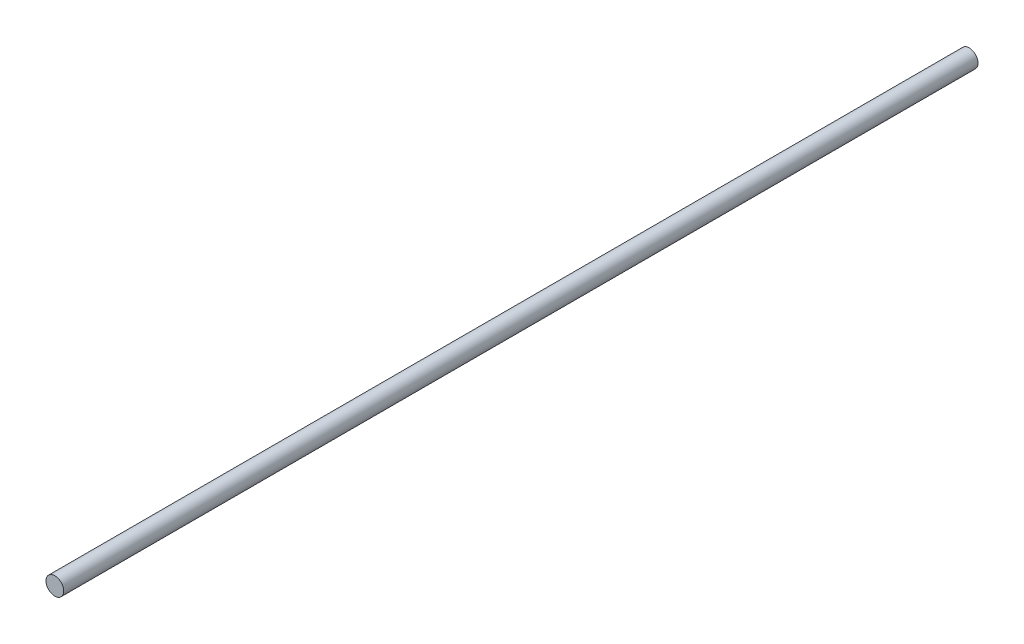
ISO-10303-21;
HEADER;
FILE_DESCRIPTION(('STEP AP214'),'2;1');
FILE_NAME('part.step','',(''),(''),'','','');
FILE_SCHEMA(('AUTOMOTIVE_DESIGN { 1 0 10303 214 1 1 1 1 }'));
ENDSEC;
DATA;
#1=APPLICATION_CONTEXT('core data for automotive mechanical design processes');
#2=APPLICATION_PROTOCOL_DEFINITION('international standard','automotive_design',2000,#1);
#3=PRODUCT_CONTEXT('',#1,'mechanical');
#4=PRODUCT('Part','Part','',(#3));
#5=PRODUCT_RELATED_PRODUCT_CATEGORY('part','',(#4));
#6=PRODUCT_DEFINITION_FORMATION('','',#4);
#7=PRODUCT_DEFINITION_CONTEXT('part definition',#1,'design');
#8=PRODUCT_DEFINITION('design','',#6,#7);
#9=PRODUCT_DEFINITION_SHAPE('','',#8);
#10=(LENGTH_UNIT() NAMED_UNIT(*) SI_UNIT(.MILLI.,.METRE.));
#11=(NAMED_UNIT(*) PLANE_ANGLE_UNIT() SI_UNIT($,.RADIAN.));
#12=(NAMED_UNIT(*) SI_UNIT($,.STERADIAN.) SOLID_ANGLE_UNIT());
#13=UNCERTAINTY_MEASURE_WITH_UNIT(LENGTH_MEASURE(1.E-05),#10,'distance_accuracy_value','');
#14=(GEOMETRIC_REPRESENTATION_CONTEXT(3) GLOBAL_UNCERTAINTY_ASSIGNED_CONTEXT((#13)) GLOBAL_UNIT_ASSIGNED_CONTEXT((#10,
#11,#12)) REPRESENTATION_CONTEXT('',''));
#15=CARTESIAN_POINT('',(0.,0.,0.));
#16=DIRECTION('',(0.,0.,1.));
#17=DIRECTION('',(1.,0.,0.));
#18=AXIS2_PLACEMENT_3D('',#15,#16,#17);
#19=CARTESIAN_POINT('',(0.,0.,-3100.));
#20=DIRECTION('',(0.,0.,1.));
#21=DIRECTION('',(1.,0.,0.));
#22=AXIS2_PLACEMENT_3D('',#19,#20,#21);
#23=CYLINDRICAL_SURFACE('',#22,30.);
#24=CARTESIAN_POINT('',(0.,0.,-3100.));
#25=DIRECTION('',(0.,0.,1.));
#26=DIRECTION('',(1.,0.,0.));
#27=AXIS2_PLACEMENT_3D('',#24,#25,#26);
#28=CIRCLE('',#27,30.);
#29=CARTESIAN_POINT('',(30.,0.,-3100.));
#30=VERTEX_POINT('',#29);
#31=EDGE_CURVE('E10',#30,#30,#28,.T.);
#32=ORIENTED_EDGE('',*,*,#31,.T.);
#33=EDGE_LOOP('',(#32));
#34=FACE_BOUND('',#33,.T.);
#35=CARTESIAN_POINT('',(0.,0.,0.));
#36=DIRECTION('',(0.,0.,1.));
#37=DIRECTION('',(1.,0.,0.));
#38=AXIS2_PLACEMENT_3D('',#35,#36,#37);
#39=CIRCLE('',#38,30.);
#40=CARTESIAN_POINT('',(30.,0.,0.));
#41=VERTEX_POINT('',#40);
#42=EDGE_CURVE('E40',#41,#41,#39,.T.);
#43=ORIENTED_EDGE('',*,*,#42,.F.);
#44=EDGE_LOOP('',(#43));
#45=FACE_BOUND('',#44,.T.);
#46=ADVANCED_FACE('F37',(#34,#45),#23,.T.);
#47=CARTESIAN_POINT('',(0.,0.,-3100.));
#48=DIRECTION('',(0.,0.,1.));
#49=DIRECTION('',(1.,0.,0.));
#50=AXIS2_PLACEMENT_3D('',#47,#48,#49);
#51=PLANE('',#50);
#52=ORIENTED_EDGE('',*,*,#31,.F.);
#53=EDGE_LOOP('',(#52));
#54=FACE_BOUND('',#53,.T.);
#55=ADVANCED_FACE('F54',(#54),#51,.F.);
#56=CARTESIAN_POINT('',(0.,0.,0.));
#57=DIRECTION('',(0.,0.,1.));
#58=DIRECTION('',(1.,0.,0.));
#59=AXIS2_PLACEMENT_3D('',#56,#57,#58);
#60=PLANE('',#59);
#61=ORIENTED_EDGE('',*,*,#42,.T.);
#62=EDGE_LOOP('',(#61));
#63=FACE_BOUND('',#62,.T.);
#64=ADVANCED_FACE('F51',(#63),#60,.T.);
#65=CLOSED_SHELL('',(#46,#55,#64));
#66=MANIFOLD_SOLID_BREP('B2',#65);
#67=ADVANCED_BREP_SHAPE_REPRESENTATION('',(#18,#66),#14);
#68=SHAPE_DEFINITION_REPRESENTATION(#9,#67);
ENDSEC;
END-ISO-10303-21;
